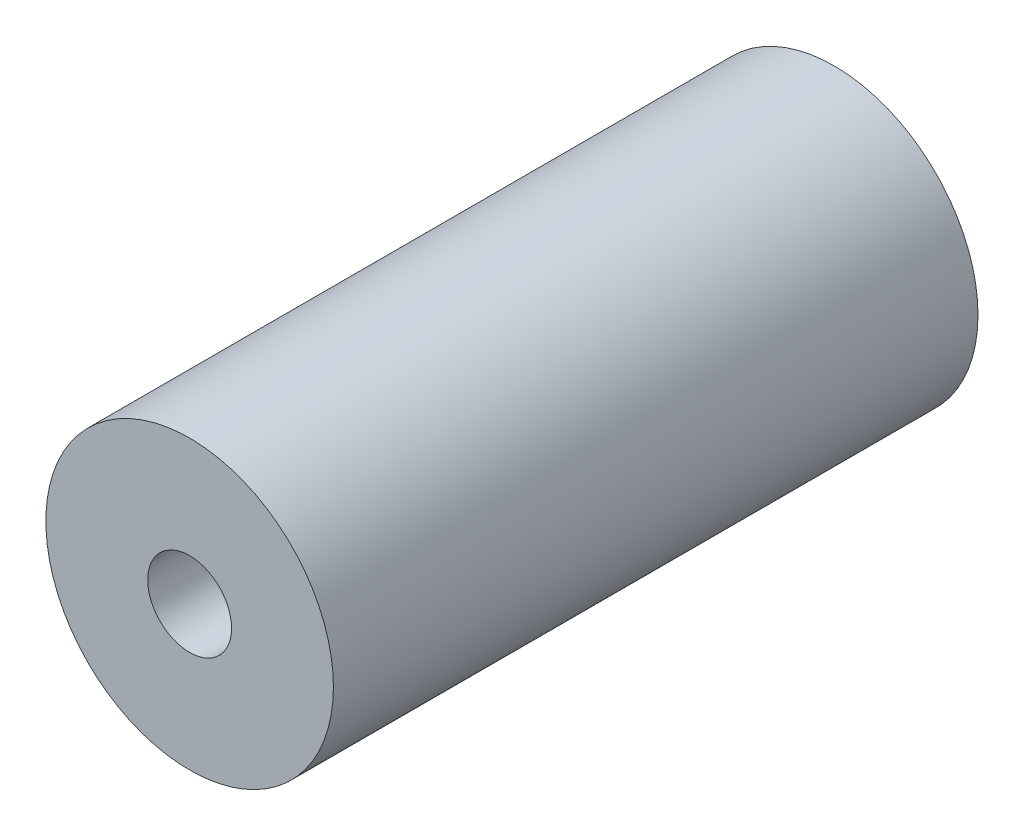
ISO-10303-21;
HEADER;
FILE_DESCRIPTION(('STEP AP214'),'2;1');
FILE_NAME('part.step','',(''),(''),'','','');
FILE_SCHEMA(('AUTOMOTIVE_DESIGN { 1 0 10303 214 1 1 1 1 }'));
ENDSEC;
DATA;
#1=APPLICATION_CONTEXT('core data for automotive mechanical design processes');
#2=APPLICATION_PROTOCOL_DEFINITION('international standard','automotive_design',2000,#1);
#3=PRODUCT_CONTEXT('',#1,'mechanical');
#4=PRODUCT('Part','Part','',(#3));
#5=PRODUCT_RELATED_PRODUCT_CATEGORY('part','',(#4));
#6=PRODUCT_DEFINITION_FORMATION('','',#4);
#7=PRODUCT_DEFINITION_CONTEXT('part definition',#1,'design');
#8=PRODUCT_DEFINITION('design','',#6,#7);
#9=PRODUCT_DEFINITION_SHAPE('','',#8);
#10=(LENGTH_UNIT() NAMED_UNIT(*) SI_UNIT(.MILLI.,.METRE.));
#11=(NAMED_UNIT(*) PLANE_ANGLE_UNIT() SI_UNIT($,.RADIAN.));
#12=(NAMED_UNIT(*) SI_UNIT($,.STERADIAN.) SOLID_ANGLE_UNIT());
#13=UNCERTAINTY_MEASURE_WITH_UNIT(LENGTH_MEASURE(1.E-05),#10,'distance_accuracy_value','');
#14=(GEOMETRIC_REPRESENTATION_CONTEXT(3) GLOBAL_UNCERTAINTY_ASSIGNED_CONTEXT((#13)) GLOBAL_UNIT_ASSIGNED_CONTEXT((#10,
#11,#12)) REPRESENTATION_CONTEXT('',''));
#15=CARTESIAN_POINT('',(0.,0.,0.));
#16=DIRECTION('',(0.,0.,1.));
#17=DIRECTION('',(1.,0.,0.));
#18=AXIS2_PLACEMENT_3D('',#15,#16,#17);
#19=CARTESIAN_POINT('',(0.,0.,26.9));
#20=DIRECTION('',(0.,0.,1.));
#21=DIRECTION('',(1.,0.,0.));
#22=AXIS2_PLACEMENT_3D('',#19,#20,#21);
#23=PLANE('',#22);
#24=CARTESIAN_POINT('',(0.,0.,26.9));
#25=DIRECTION('',(0.,0.,1.));
#26=DIRECTION('',(1.,0.,0.));
#27=AXIS2_PLACEMENT_3D('',#24,#25,#26);
#28=CIRCLE('',#27,6.);
#29=CARTESIAN_POINT('',(6.,0.,26.9));
#30=VERTEX_POINT('',#29);
#31=EDGE_CURVE('E10',#30,#30,#28,.T.);
#32=ORIENTED_EDGE('',*,*,#31,.T.);
#33=EDGE_LOOP('',(#32));
#34=FACE_BOUND('',#33,.T.);
#35=CARTESIAN_POINT('',(0.,0.,26.9));
#36=DIRECTION('',(0.,0.,1.));
#37=DIRECTION('',(1.,0.,0.));
#38=AXIS2_PLACEMENT_3D('',#35,#36,#37);
#39=CIRCLE('',#38,1.75);
#40=CARTESIAN_POINT('',(1.75,0.,26.9));
#41=VERTEX_POINT('',#40);
#42=EDGE_CURVE('E42',#41,#41,#39,.T.);
#43=ORIENTED_EDGE('',*,*,#42,.F.);
#44=EDGE_LOOP('',(#43));
#45=FACE_BOUND('',#44,.T.);
#46=ADVANCED_FACE('F31',(#34,#45),#23,.T.);
#47=CARTESIAN_POINT('',(0.,0.,0.));
#48=DIRECTION('',(0.,0.,1.));
#49=DIRECTION('',(1.,0.,0.));
#50=AXIS2_PLACEMENT_3D('',#47,#48,#49);
#51=PLANE('',#50);
#52=CARTESIAN_POINT('',(0.,0.,0.));
#53=DIRECTION('',(0.,0.,1.));
#54=DIRECTION('',(1.,0.,0.));
#55=AXIS2_PLACEMENT_3D('',#52,#53,#54);
#56=CIRCLE('',#55,6.);
#57=CARTESIAN_POINT('',(6.,0.,0.));
#58=VERTEX_POINT('',#57);
#59=EDGE_CURVE('E35',#58,#58,#56,.T.);
#60=ORIENTED_EDGE('',*,*,#59,.F.);
#61=EDGE_LOOP('',(#60));
#62=FACE_BOUND('',#61,.T.);
#63=CARTESIAN_POINT('',(0.,0.,0.));
#64=DIRECTION('',(0.,0.,1.));
#65=DIRECTION('',(1.,0.,0.));
#66=AXIS2_PLACEMENT_3D('',#63,#64,#65);
#67=CIRCLE('',#66,1.75);
#68=CARTESIAN_POINT('',(1.75,0.,0.));
#69=VERTEX_POINT('',#68);
#70=EDGE_CURVE('E44',#69,#69,#67,.T.);
#71=ORIENTED_EDGE('',*,*,#70,.T.);
#72=EDGE_LOOP('',(#71));
#73=FACE_BOUND('',#72,.T.);
#74=ADVANCED_FACE('F54',(#62,#73),#51,.F.);
#75=CARTESIAN_POINT('',(0.,0.,26.9));
#76=DIRECTION('',(0.,0.,-1.));
#77=DIRECTION('',(-1.,0.,0.));
#78=AXIS2_PLACEMENT_3D('',#75,#76,#77);
#79=CYLINDRICAL_SURFACE('',#78,6.);
#80=ORIENTED_EDGE('',*,*,#31,.F.);
#81=EDGE_LOOP('',(#80));
#82=FACE_BOUND('',#81,.T.);
#83=ORIENTED_EDGE('',*,*,#59,.T.);
#84=EDGE_LOOP('',(#83));
#85=FACE_BOUND('',#84,.T.);
#86=ADVANCED_FACE('F33',(#82,#85),#79,.T.);
#87=CARTESIAN_POINT('',(0.,0.,26.9));
#88=DIRECTION('',(0.,0.,-1.));
#89=DIRECTION('',(-1.,0.,0.));
#90=AXIS2_PLACEMENT_3D('',#87,#88,#89);
#91=CYLINDRICAL_SURFACE('',#90,1.75);
#92=ORIENTED_EDGE('',*,*,#42,.T.);
#93=EDGE_LOOP('',(#92));
#94=FACE_BOUND('',#93,.T.);
#95=ORIENTED_EDGE('',*,*,#70,.F.);
#96=EDGE_LOOP('',(#95));
#97=FACE_BOUND('',#96,.T.);
#98=ADVANCED_FACE('F50',(#94,#97),#91,.F.);
#99=CLOSED_SHELL('',(#46,#74,#86,#98));
#100=MANIFOLD_SOLID_BREP('B2',#99);
#101=ADVANCED_BREP_SHAPE_REPRESENTATION('',(#18,#100),#14);
#102=SHAPE_DEFINITION_REPRESENTATION(#9,#101);
ENDSEC;
END-ISO-10303-21;
